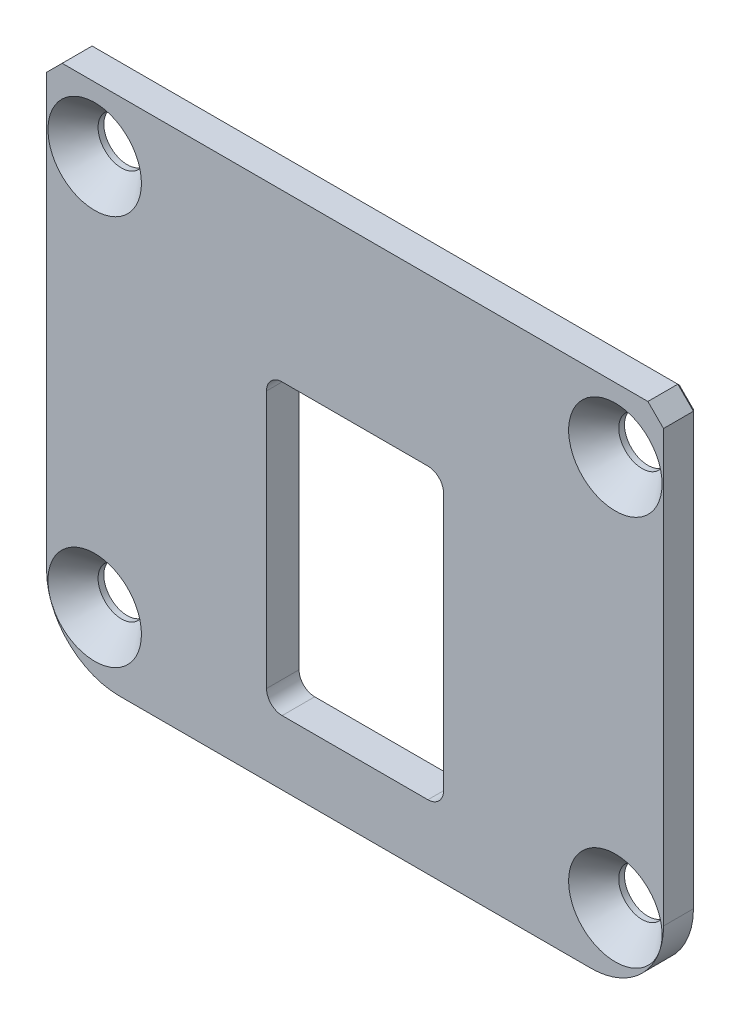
from build123d import *

# Parameters (mm, degrees)
SKETCH1_W                                     = 60.198
SKETCH1_H                                     = 50.673
BOSS_EXTRUDE1_DEPTH                           = 3.175
CHAMFER1_SIZE                                 = 1.524
FILLET1_R                                     = 7.112
CSK_FOR_8_FLAT_HEAD_SOCKET_CAP_SCREW1_A_COUNT = 2
CSK_FOR_8_FLAT_HEAD_SOCKET_CAP_SCREW1_A_PITCH = 38.1
CSK_FOR_8_FLAT_HEAD_SOCKET_CAP_SCRE_2_COUNT   = 2
CSK_FOR_8_FLAT_HEAD_SOCKET_CAP_SCRE_2_PITCH   = 63.5
CSK_FOR_8_FLAT_HEAD_SOCKET_CAP_SCRE_3_COUNT   = 2
CSK_FOR_8_FLAT_HEAD_SOCKET_CAP_SCRE_3_PITCH   = 50.8
CHAMFER2_SIZE                                 = 0.254
CUT_EXTRUDE1_DEPTH                            = 60.023583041


with BuildPart() as part:
    # Sketch1 → Boss-Extrude1 (new body)
    with BuildSketch(Plane.XY):
        with Locations((0, -25.3365)):
            Rectangle(SKETCH1_W, SKETCH1_H)
    extrude(amount=-BOSS_EXTRUDE1_DEPTH)

    # Chamfer1
    chamfer1_edges = [part.edges().sort_by_distance(p)[0] for p in [
        (-30.099, 0, -1.5875),
        (30.099, 0, -1.5875),
    ]]
    chamfer(chamfer1_edges, length=CHAMFER1_SIZE)

    # Fillet1
    fillet1_edges = [part.edges().sort_by_distance(p)[0] for p in [
        (30.099, -50.673, -1.5875),
        (-30.099, -50.673, -1.5875),
    ]]
    fillet(fillet1_edges, radius=FILLET1_R)

    # Sketch3 → CSK for _8 Flat Head Socket Cap Screw1 (revolve, cut)
    with BuildSketch(Plane(origin=(-25.4, -6.2865, 0), x_dir=(0, -1, 0), z_dir=(1, 0, 0))):
        Polygon((0, 0), (0, 3.175), (2.286, 3.175), (2.286, 2.6151325), (4.5593, 0), align=None)
    csk_for_8_flat_head_socket_cap_screw1 = revolve(axis=Axis((-25.4, -6.2865, 6.35), (0, 0, -1)), mode=Mode.SUBTRACT)

    # CSK for _8 Flat Head Socket Cap Screw1 a: CSK for _8 Flat Head Socket Cap Screw1 ×2
    with Locations(*[(0, -i * CSK_FOR_8_FLAT_HEAD_SOCKET_CAP_SCREW1_A_PITCH, 0) for i in range(1, CSK_FOR_8_FLAT_HEAD_SOCKET_CAP_SCREW1_A_COUNT)]):
        add(csk_for_8_flat_head_socket_cap_screw1, mode=Mode.SUBTRACT)

    # CSK for _8 Flat Head Socket Cap Scre 2: CSK for _8 Flat Head Socket Cap Screw1 ×2
    with Locations(*[Vector(0.8, -0.5999999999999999, 0) * (i * CSK_FOR_8_FLAT_HEAD_SOCKET_CAP_SCRE_2_PITCH) for i in range(1, CSK_FOR_8_FLAT_HEAD_SOCKET_CAP_SCRE_2_COUNT)]):
        add(csk_for_8_flat_head_socket_cap_screw1, mode=Mode.SUBTRACT)

    # CSK for _8 Flat Head Socket Cap Scre 3: CSK for _8 Flat Head Socket Cap Screw1 ×2
    with Locations(*[(i * CSK_FOR_8_FLAT_HEAD_SOCKET_CAP_SCRE_3_PITCH, 0, 0) for i in range(1, CSK_FOR_8_FLAT_HEAD_SOCKET_CAP_SCRE_3_COUNT)]):
        add(csk_for_8_flat_head_socket_cap_screw1, mode=Mode.SUBTRACT)

    # Chamfer2
    chamfer2_edges = [part.edges().sort_by_distance(p)[0] for p in [
        (0, 0, -3.175),
        (-30.099, -22.5425, -3.175),
        (29.337, -0.762, -3.175),
        (-29.337, -0.762, -3.175),
        (0, -50.673, -3.175),
        (30.099, -22.5425, -3.175),
        (28.015943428, -48.589943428, -3.175),
        (-28.015943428, -48.589943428, -3.175),
    ]]
    chamfer(chamfer2_edges, length=CHAMFER2_SIZE)

    # Sketch4 → Cut-Extrude1 (cut, through all)
    with BuildSketch(Plane.XY):
        with BuildLine():
            Line((-7.112, -16.1925), (7.112, -16.1925))
            ThreePointArc((7.112, -16.1925), (8.189630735, -16.638869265), (8.636, -17.7165))
            Line((8.636, -17.7165), (8.636, -42.8625))
            ThreePointArc((8.636, -42.8625), (8.189630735, -43.940130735), (7.112, -44.3865))
            Line((7.112, -44.3865), (-7.112, -44.3865))
            ThreePointArc((-7.112, -44.3865), (-8.189630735, -43.940130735), (-8.636, -42.8625))
            Line((-8.636, -42.8625), (-8.636, -17.7165))
            ThreePointArc((-8.636, -17.7165), (-8.189630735, -16.638869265), (-7.112, -16.1925))
        make_face()
    extrude(amount=-CUT_EXTRUDE1_DEPTH, mode=Mode.SUBTRACT)


solid = part.part
